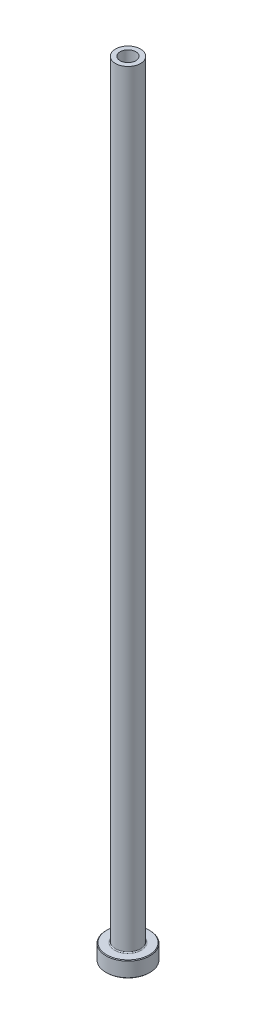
ISO-10303-21;
HEADER;
FILE_DESCRIPTION(('STEP AP214'),'2;1');
FILE_NAME('part.step','',(''),(''),'','','');
FILE_SCHEMA(('AUTOMOTIVE_DESIGN { 1 0 10303 214 1 1 1 1 }'));
ENDSEC;
DATA;
#1=APPLICATION_CONTEXT('core data for automotive mechanical design processes');
#2=APPLICATION_PROTOCOL_DEFINITION('international standard','automotive_design',2000,#1);
#3=PRODUCT_CONTEXT('',#1,'mechanical');
#4=PRODUCT('Part','Part','',(#3));
#5=PRODUCT_RELATED_PRODUCT_CATEGORY('part','',(#4));
#6=PRODUCT_DEFINITION_FORMATION('','',#4);
#7=PRODUCT_DEFINITION_CONTEXT('part definition',#1,'design');
#8=PRODUCT_DEFINITION('design','',#6,#7);
#9=PRODUCT_DEFINITION_SHAPE('','',#8);
#10=(LENGTH_UNIT() NAMED_UNIT(*) SI_UNIT(.MILLI.,.METRE.));
#11=(NAMED_UNIT(*) PLANE_ANGLE_UNIT() SI_UNIT($,.RADIAN.));
#12=(NAMED_UNIT(*) SI_UNIT($,.STERADIAN.) SOLID_ANGLE_UNIT());
#13=UNCERTAINTY_MEASURE_WITH_UNIT(LENGTH_MEASURE(1.E-05),#10,'distance_accuracy_value','');
#14=(GEOMETRIC_REPRESENTATION_CONTEXT(3) GLOBAL_UNCERTAINTY_ASSIGNED_CONTEXT((#13)) GLOBAL_UNIT_ASSIGNED_CONTEXT((#10,
#11,#12)) REPRESENTATION_CONTEXT('',''));
#15=CARTESIAN_POINT('',(0.,0.,0.));
#16=DIRECTION('',(0.,0.,1.));
#17=DIRECTION('',(1.,0.,0.));
#18=AXIS2_PLACEMENT_3D('',#15,#16,#17);
#19=CARTESIAN_POINT('',(0.,92.1876809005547,0.));
#20=DIRECTION('',(0.,1.,0.));
#21=DIRECTION('',(0.,0.,1.));
#22=AXIS2_PLACEMENT_3D('',#19,#20,#21);
#23=CYLINDRICAL_SURFACE('',#22,2.50000000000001);
#24=CARTESIAN_POINT('',(0.,250.,0.));
#25=DIRECTION('',(0.,1.,0.));
#26=DIRECTION('',(0.,0.,1.));
#27=AXIS2_PLACEMENT_3D('',#24,#25,#26);
#28=CIRCLE('',#27,2.50000000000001);
#29=CARTESIAN_POINT('',(0.,250.,2.50000000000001));
#30=VERTEX_POINT('',#29);
#31=EDGE_CURVE('E62',#30,#30,#28,.T.);
#32=ORIENTED_EDGE('',*,*,#31,.T.);
#33=EDGE_LOOP('',(#32));
#34=FACE_BOUND('',#33,.T.);
#35=CARTESIAN_POINT('',(0.,205.,0.));
#36=DIRECTION('',(0.,1.,0.));
#37=DIRECTION('',(0.,0.,1.));
#38=AXIS2_PLACEMENT_3D('',#35,#36,#37);
#39=CIRCLE('',#38,2.50000000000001);
#40=CARTESIAN_POINT('',(0.,205.,2.50000000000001));
#41=VERTEX_POINT('',#40);
#42=EDGE_CURVE('E71',#41,#41,#39,.T.);
#43=ORIENTED_EDGE('',*,*,#42,.F.);
#44=EDGE_LOOP('',(#43));
#45=FACE_BOUND('',#44,.T.);
#46=ADVANCED_FACE('F30',(#34,#45),#23,.F.);
#47=CARTESIAN_POINT('',(-2.50000000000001,250.,0.));
#48=DIRECTION('',(0.,1.,0.));
#49=DIRECTION('',(0.,0.,1.));
#50=AXIS2_PLACEMENT_3D('',#47,#48,#49);
#51=PLANE('',#50);
#52=CARTESIAN_POINT('',(0.,250.,0.));
#53=DIRECTION('',(0.,1.,0.));
#54=DIRECTION('',(0.,0.,1.));
#55=AXIS2_PLACEMENT_3D('',#52,#53,#54);
#56=CIRCLE('',#55,4.00000000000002);
#57=CARTESIAN_POINT('',(0.,250.,4.00000000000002));
#58=VERTEX_POINT('',#57);
#59=EDGE_CURVE('E65',#58,#58,#56,.T.);
#60=ORIENTED_EDGE('',*,*,#59,.T.);
#61=EDGE_LOOP('',(#60));
#62=FACE_BOUND('',#61,.T.);
#63=ORIENTED_EDGE('',*,*,#31,.F.);
#64=EDGE_LOOP('',(#63));
#65=FACE_BOUND('',#64,.T.);
#66=ADVANCED_FACE('F79',(#62,#65),#51,.T.);
#67=CARTESIAN_POINT('',(0.,92.1876809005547,0.));
#68=DIRECTION('',(0.,1.,0.));
#69=DIRECTION('',(0.,0.,1.));
#70=AXIS2_PLACEMENT_3D('',#67,#68,#69);
#71=CYLINDRICAL_SURFACE('',#70,4.);
#72=CARTESIAN_POINT('',(0.,5.3,0.));
#73=DIRECTION('',(0.,1.,0.));
#74=DIRECTION('',(0.,0.,1.));
#75=AXIS2_PLACEMENT_3D('',#72,#73,#74);
#76=CIRCLE('',#75,4.);
#77=CARTESIAN_POINT('',(0.,5.3,4.));
#78=VERTEX_POINT('',#77);
#79=EDGE_CURVE('E59',#78,#78,#76,.T.);
#80=ORIENTED_EDGE('',*,*,#79,.T.);
#81=EDGE_LOOP('',(#80));
#82=FACE_BOUND('',#81,.T.);
#83=ORIENTED_EDGE('',*,*,#59,.F.);
#84=EDGE_LOOP('',(#83));
#85=FACE_BOUND('',#84,.T.);
#86=ADVANCED_FACE('F85',(#82,#85),#71,.T.);
#87=CARTESIAN_POINT('',(-3.99999999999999,5.,0.));
#88=DIRECTION('',(0.,1.,0.));
#89=DIRECTION('',(0.,0.,1.));
#90=AXIS2_PLACEMENT_3D('',#87,#88,#89);
#91=PLANE('',#90);
#92=CARTESIAN_POINT('',(0.,5.,0.));
#93=DIRECTION('',(0.,1.,0.));
#94=DIRECTION('',(0.,0.,1.));
#95=AXIS2_PLACEMENT_3D('',#92,#93,#94);
#96=CIRCLE('',#95,6.79999999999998);
#97=CARTESIAN_POINT('',(0.,5.,6.79999999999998));
#98=VERTEX_POINT('',#97);
#99=EDGE_CURVE('E53',#98,#98,#96,.T.);
#100=ORIENTED_EDGE('',*,*,#99,.T.);
#101=EDGE_LOOP('',(#100));
#102=FACE_BOUND('',#101,.T.);
#103=CARTESIAN_POINT('',(0.,5.,0.));
#104=DIRECTION('',(0.,1.,0.));
#105=DIRECTION('',(0.,0.,1.));
#106=AXIS2_PLACEMENT_3D('',#103,#104,#105);
#107=CIRCLE('',#106,4.3);
#108=CARTESIAN_POINT('',(0.,5.,4.3));
#109=VERTEX_POINT('',#108);
#110=EDGE_CURVE('E56',#109,#109,#107,.F.);
#111=ORIENTED_EDGE('',*,*,#110,.T.);
#112=EDGE_LOOP('',(#111));
#113=FACE_BOUND('',#112,.T.);
#114=ADVANCED_FACE('F111',(#102,#113),#91,.T.);
#115=CARTESIAN_POINT('',(0.,92.1876809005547,0.));
#116=DIRECTION('',(0.,1.,0.));
#117=DIRECTION('',(0.,0.,1.));
#118=AXIS2_PLACEMENT_3D('',#115,#116,#117);
#119=CYLINDRICAL_SURFACE('',#118,6.99999999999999);
#120=CARTESIAN_POINT('',(0.,4.8,0.));
#121=DIRECTION('',(0.,1.,0.));
#122=DIRECTION('',(0.,0.,1.));
#123=AXIS2_PLACEMENT_3D('',#120,#121,#122);
#124=CIRCLE('',#123,6.99999999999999);
#125=CARTESIAN_POINT('',(0.,4.8,6.99999999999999));
#126=VERTEX_POINT('',#125);
#127=EDGE_CURVE('E45',#126,#126,#124,.F.);
#128=ORIENTED_EDGE('',*,*,#127,.T.);
#129=EDGE_LOOP('',(#128));
#130=FACE_BOUND('',#129,.T.);
#131=CARTESIAN_POINT('',(0.,0.199999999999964,0.));
#132=DIRECTION('',(0.,-1.,0.));
#133=DIRECTION('',(0.,0.,-1.));
#134=AXIS2_PLACEMENT_3D('',#131,#132,#133);
#135=CIRCLE('',#134,6.99999999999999);
#136=CARTESIAN_POINT('',(0.,0.199999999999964,-6.99999999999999));
#137=VERTEX_POINT('',#136);
#138=EDGE_CURVE('E50',#137,#137,#135,.F.);
#139=ORIENTED_EDGE('',*,*,#138,.T.);
#140=EDGE_LOOP('',(#139));
#141=FACE_BOUND('',#140,.T.);
#142=ADVANCED_FACE('F108',(#130,#141),#119,.T.);
#143=CARTESIAN_POINT('',(-6.99999999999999,0.,0.));
#144=DIRECTION('',(0.,-1.,0.));
#145=DIRECTION('',(0.,0.,-1.));
#146=AXIS2_PLACEMENT_3D('',#143,#144,#145);
#147=PLANE('',#146);
#148=CARTESIAN_POINT('',(0.,0.,0.));
#149=DIRECTION('',(0.,-1.,0.));
#150=DIRECTION('',(0.,0.,-1.));
#151=AXIS2_PLACEMENT_3D('',#148,#149,#150);
#152=CIRCLE('',#151,3.24999999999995);
#153=CARTESIAN_POINT('',(0.,0.,-3.24999999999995));
#154=VERTEX_POINT('',#153);
#155=EDGE_CURVE('E37',#154,#154,#152,.F.);
#156=ORIENTED_EDGE('',*,*,#155,.T.);
#157=EDGE_LOOP('',(#156));
#158=FACE_BOUND('',#157,.T.);
#159=CARTESIAN_POINT('',(0.,0.,0.));
#160=DIRECTION('',(0.,-1.,0.));
#161=DIRECTION('',(0.,0.,-1.));
#162=AXIS2_PLACEMENT_3D('',#159,#160,#161);
#163=CIRCLE('',#162,6.80000000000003);
#164=CARTESIAN_POINT('',(0.,0.,-6.80000000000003));
#165=VERTEX_POINT('',#164);
#166=EDGE_CURVE('E41',#165,#165,#163,.T.);
#167=ORIENTED_EDGE('',*,*,#166,.T.);
#168=EDGE_LOOP('',(#167));
#169=FACE_BOUND('',#168,.T.);
#170=ADVANCED_FACE('F110',(#158,#169),#147,.T.);
#171=CARTESIAN_POINT('',(0.,92.1876809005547,0.));
#172=DIRECTION('',(0.,1.,0.));
#173=DIRECTION('',(0.,0.,1.));
#174=AXIS2_PLACEMENT_3D('',#171,#172,#173);
#175=CYLINDRICAL_SURFACE('',#174,2.75);
#176=CARTESIAN_POINT('',(0.,0.499999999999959,0.));
#177=DIRECTION('',(0.,-1.,0.));
#178=DIRECTION('',(0.,0.,-1.));
#179=AXIS2_PLACEMENT_3D('',#176,#177,#178);
#180=CIRCLE('',#179,2.75);
#181=CARTESIAN_POINT('',(0.,0.499999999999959,-2.75));
#182=VERTEX_POINT('',#181);
#183=EDGE_CURVE('E10',#182,#182,#180,.T.);
#184=ORIENTED_EDGE('',*,*,#183,.T.);
#185=EDGE_LOOP('',(#184));
#186=FACE_BOUND('',#185,.T.);
#187=CARTESIAN_POINT('',(0.,193.,0.));
#188=DIRECTION('',(0.,1.,0.));
#189=DIRECTION('',(0.,0.,1.));
#190=AXIS2_PLACEMENT_3D('',#187,#188,#189);
#191=CIRCLE('',#190,2.75000000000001);
#192=CARTESIAN_POINT('',(0.,193.,2.75000000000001));
#193=VERTEX_POINT('',#192);
#194=EDGE_CURVE('E68',#193,#193,#191,.T.);
#195=ORIENTED_EDGE('',*,*,#194,.T.);
#196=EDGE_LOOP('',(#195));
#197=FACE_BOUND('',#196,.T.);
#198=ADVANCED_FACE('F118',(#186,#197),#175,.F.);
#199=CARTESIAN_POINT('',(0.,193.,0.));
#200=DIRECTION('',(0.,-1.,0.));
#201=DIRECTION('',(0.,0.,-1.));
#202=AXIS2_PLACEMENT_3D('',#199,#200,#201);
#203=CONICAL_SURFACE('',#202,2.75000000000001,0.0208303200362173);
#204=ORIENTED_EDGE('',*,*,#42,.T.);
#205=EDGE_LOOP('',(#204));
#206=FACE_BOUND('',#205,.T.);
#207=ORIENTED_EDGE('',*,*,#194,.F.);
#208=EDGE_LOOP('',(#207));
#209=FACE_BOUND('',#208,.T.);
#210=ADVANCED_FACE('F75',(#206,#209),#203,.F.);
#211=CARTESIAN_POINT('',(0.,5.3,0.));
#212=DIRECTION('',(0.,1.,0.));
#213=DIRECTION('',(0.,0.,1.));
#214=AXIS2_PLACEMENT_3D('',#211,#212,#213);
#215=TOROIDAL_SURFACE('',#214,4.3,0.3);
#216=ORIENTED_EDGE('',*,*,#110,.F.);
#217=EDGE_LOOP('',(#216));
#218=FACE_BOUND('',#217,.T.);
#219=ORIENTED_EDGE('',*,*,#79,.F.);
#220=EDGE_LOOP('',(#219));
#221=FACE_BOUND('',#220,.T.);
#222=ADVANCED_FACE('F90',(#218,#221),#215,.F.);
#223=CARTESIAN_POINT('',(0.,5.,0.));
#224=DIRECTION('',(0.,-1.,0.));
#225=DIRECTION('',(0.,0.,-1.));
#226=AXIS2_PLACEMENT_3D('',#223,#224,#225);
#227=CONICAL_SURFACE('',#226,6.79999999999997,0.785398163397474);
#228=ORIENTED_EDGE('',*,*,#127,.F.);
#229=EDGE_LOOP('',(#228));
#230=FACE_BOUND('',#229,.T.);
#231=ORIENTED_EDGE('',*,*,#99,.F.);
#232=EDGE_LOOP('',(#231));
#233=FACE_BOUND('',#232,.T.);
#234=ADVANCED_FACE('F93',(#230,#233),#227,.T.);
#235=CARTESIAN_POINT('',(0.,0.199999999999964,0.));
#236=DIRECTION('',(0.,1.,0.));
#237=DIRECTION('',(0.,0.,1.));
#238=AXIS2_PLACEMENT_3D('',#235,#236,#237);
#239=CONICAL_SURFACE('',#238,6.99999999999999,0.78539816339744);
#240=ORIENTED_EDGE('',*,*,#166,.F.);
#241=EDGE_LOOP('',(#240));
#242=FACE_BOUND('',#241,.T.);
#243=ORIENTED_EDGE('',*,*,#138,.F.);
#244=EDGE_LOOP('',(#243));
#245=FACE_BOUND('',#244,.T.);
#246=ADVANCED_FACE('F96',(#242,#245),#239,.T.);
#247=CARTESIAN_POINT('',(0.,0.,0.));
#248=DIRECTION('',(0.,-1.,0.));
#249=DIRECTION('',(0.,0.,-1.));
#250=AXIS2_PLACEMENT_3D('',#247,#248,#249);
#251=CONICAL_SURFACE('',#250,3.24999999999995,0.785398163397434);
#252=ORIENTED_EDGE('',*,*,#183,.F.);
#253=EDGE_LOOP('',(#252));
#254=FACE_BOUND('',#253,.T.);
#255=ORIENTED_EDGE('',*,*,#155,.F.);
#256=EDGE_LOOP('',(#255));
#257=FACE_BOUND('',#256,.T.);
#258=ADVANCED_FACE('F32',(#254,#257),#251,.F.);
#259=CLOSED_SHELL('',(#46,#66,#86,#114,#142,#170,#198,#210,#222,#234,#246,#258));
#260=MANIFOLD_SOLID_BREP('B2',#259);
#261=ADVANCED_BREP_SHAPE_REPRESENTATION('',(#18,#260),#14);
#262=SHAPE_DEFINITION_REPRESENTATION(#9,#261);
ENDSEC;
END-ISO-10303-21;
